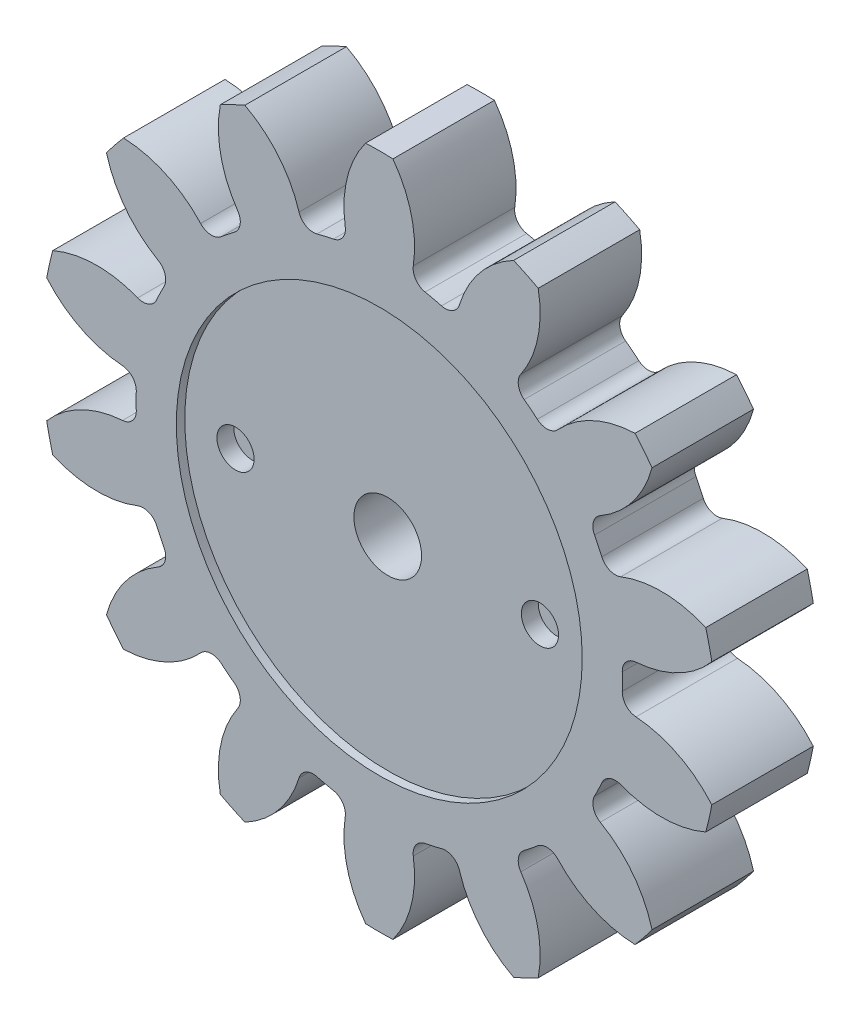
from build123d import *

# Parameters (mm, degrees)
BOSS_EXTRU_1_DEPTH                 = 6
CONG_1_R                           = 0.875
R_P_TITION_CIRCULAIRE4_COUNT       = 14
CONG_1_OF_R_P_TITION_CIRCULAIRE4_R = 0.875
ESQUISSE6_R                        = 12
ENL_V_MAT_EXTRU_1_DEPTH            = 0.5
ESQUISSE7_R                        = 2
ENL_V_MAT_EXTRU_2_DEPTH            = 30.928282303
ESQUISSE8_R                        = 1.1
ENL_V_MAT_EXTRU_3_DEPTH            = 1


with BuildPart() as part:
    # Esquisse3 → Boss.-Extru.1 (new body)
    with BuildSketch(Plane.XY):
        with BuildLine():
            Line((-4.577445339, 13.454236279), (-1.378706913, -0.560352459))
            Line((-1.378706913, -0.560352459), (1.820031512, 13.454236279))
            ThreePointArc((1.820031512, 13.454236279), (1.134989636, 13.593161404), (0.444004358, 13.69862186))
            ThreePointArc((0.444004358, 13.69862186), (0.608952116, 16.680304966), (-0.571450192, 19.423349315))
            ThreePointArc((-0.571450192, 19.423349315), (-1.378706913, 19.439647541), (-2.185963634, 19.423349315))
            ThreePointArc((-2.185963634, 19.423349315), (-3.366365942, 16.680304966), (-3.201418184, 13.69862186))
            ThreePointArc((-3.201418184, 13.69862186), (-3.892403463, 13.593161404), (-4.577445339, 13.454236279))
        make_face()
    boss_extru_1 = extrude(amount=BOSS_EXTRU_1_DEPTH)

    # Cong_1
    cong_1_edges = [part.edges().sort_by_distance(p)[0] for p in [
        (-3.201418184, 13.69862186, 3),
        (0.444004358, 13.69862186, 3),
    ]]
    fillet(cong_1_edges, radius=CONG_1_R)

    # R_p_tition circulaire4: Boss.-Extru.1 ×14 about axis
    r_p_tition_circulaire4_axis = Axis((-1.378706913, -0.560352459, 0), (0, 0, 1))
    for i in range(1, R_P_TITION_CIRCULAIRE4_COUNT):
        add(boss_extru_1.rotate(r_p_tition_circulaire4_axis, i * 360 / R_P_TITION_CIRCULAIRE4_COUNT))

    # Cong_1 of R_p_tition circulaire4
    cong_1_of_r_p_tition_circulaire4_edges = [part.edges().sort_by_distance(p)[0] for p in [
        (-9.207650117, 11.495694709, 3),
        (-5.923237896, 13.077384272, 3),
        (-13.663263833, 6.904919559, 3),
        (-11.390380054, 9.755025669, 3),
        (-15.68577039, 0.83555573, 3),
        (-14.874587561, 4.389579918, 3),
        (-14.874587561, -5.510284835, 3),
        (-15.68577039, -1.956260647, 3),
        (-11.390380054, -10.875730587, 3),
        (-13.663263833, -8.025624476, 3),
        (-5.923237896, -14.19808919, 3),
        (-9.207650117, -12.616399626, 3),
        (0.444004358, -14.819326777, 3),
        (-3.201418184, -14.819326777, 3),
        (6.450236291, -12.616399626, 3),
        (3.16582407, -14.19808919, 3),
        (10.905850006, -8.025624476, 3),
        (8.632966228, -10.875730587, 3),
        (12.928356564, -1.956260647, 3),
        (12.117173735, -5.510284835, 3),
        (12.117173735, 4.389579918, 3),
        (12.928356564, 0.83555573, 3),
        (8.632966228, 9.755025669, 3),
        (10.905850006, 6.904919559, 3),
        (3.16582407, 13.077384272, 3),
        (6.450236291, 11.495694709, 3),
    ]]
    fillet(cong_1_of_r_p_tition_circulaire4_edges, radius=CONG_1_OF_R_P_TITION_CIRCULAIRE4_R)

    # Esquisse6 → Enl_v. mat.-Extru.1 (cut)
    with BuildSketch(Plane.XY.offset(6)):
        with Locations((-1.378706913, -0.560352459)):
            Circle(ESQUISSE6_R)
    extrude(amount=-ENL_V_MAT_EXTRU_1_DEPTH, mode=Mode.SUBTRACT)

    # Esquisse7 → Enl_v. mat.-Extru.2 (cut, through all)
    with BuildSketch(Plane.XY.offset(5.5)):
        with Locations((-1.378706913, -0.560352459)):
            Circle(ESQUISSE7_R)
    extrude(amount=-ENL_V_MAT_EXTRU_2_DEPTH, mode=Mode.SUBTRACT)

    # Esquisse8 → Enl_v. mat.-Extru.3 (cut)
    with BuildSketch(Plane.XY.offset(5.5)):
        with Locations((-10.378706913, -0.560352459)):
            Circle(ESQUISSE8_R)
        with Locations(Location((7.621293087, -0.560352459, 0), (0, 0, 180))):
            Circle(ESQUISSE8_R)
    extrude(amount=-ENL_V_MAT_EXTRU_3_DEPTH, mode=Mode.SUBTRACT)


solid = part.part
